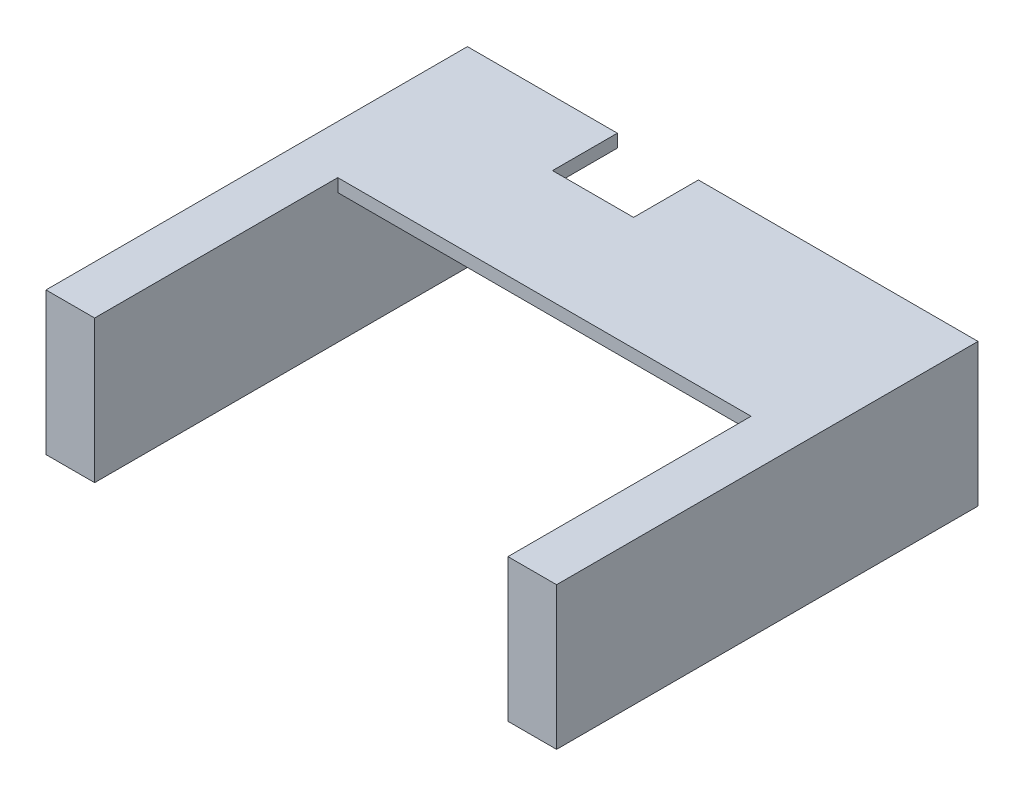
ISO-10303-21;
HEADER;
FILE_DESCRIPTION(('STEP AP214'),'2;1');
FILE_NAME('part.step','',(''),(''),'','','');
FILE_SCHEMA(('AUTOMOTIVE_DESIGN { 1 0 10303 214 1 1 1 1 }'));
ENDSEC;
DATA;
#1=APPLICATION_CONTEXT('core data for automotive mechanical design processes');
#2=APPLICATION_PROTOCOL_DEFINITION('international standard','automotive_design',2000,#1);
#3=PRODUCT_CONTEXT('',#1,'mechanical');
#4=PRODUCT('Part','Part','',(#3));
#5=PRODUCT_RELATED_PRODUCT_CATEGORY('part','',(#4));
#6=PRODUCT_DEFINITION_FORMATION('','',#4);
#7=PRODUCT_DEFINITION_CONTEXT('part definition',#1,'design');
#8=PRODUCT_DEFINITION('design','',#6,#7);
#9=PRODUCT_DEFINITION_SHAPE('','',#8);
#10=(LENGTH_UNIT() NAMED_UNIT(*) SI_UNIT(.MILLI.,.METRE.));
#11=(NAMED_UNIT(*) PLANE_ANGLE_UNIT() SI_UNIT($,.RADIAN.));
#12=(NAMED_UNIT(*) SI_UNIT($,.STERADIAN.) SOLID_ANGLE_UNIT());
#13=UNCERTAINTY_MEASURE_WITH_UNIT(LENGTH_MEASURE(1.E-05),#10,'distance_accuracy_value','');
#14=(GEOMETRIC_REPRESENTATION_CONTEXT(3) GLOBAL_UNCERTAINTY_ASSIGNED_CONTEXT((#13)) GLOBAL_UNIT_ASSIGNED_CONTEXT((#10,
#11,#12)) REPRESENTATION_CONTEXT('',''));
#15=CARTESIAN_POINT('',(0.,0.,0.));
#16=DIRECTION('',(0.,0.,1.));
#17=DIRECTION('',(1.,0.,0.));
#18=AXIS2_PLACEMENT_3D('',#15,#16,#17);
#19=CARTESIAN_POINT('',(0.,0.,0.));
#20=DIRECTION('',(0.,0.,-1.));
#21=DIRECTION('',(-1.,0.,0.));
#22=AXIS2_PLACEMENT_3D('',#19,#20,#21);
#23=PLANE('',#22);
#24=DIRECTION('',(0.,1.,0.));
#25=VECTOR('',#24,1.);
#26=CARTESIAN_POINT('',(142.5,0.,0.));
#27=LINE('',#26,#25);
#28=CARTESIAN_POINT('',(142.5,80.,0.));
#29=VERTEX_POINT('',#28);
#30=CARTESIAN_POINT('',(142.5,88.,0.));
#31=VERTEX_POINT('',#30);
#32=EDGE_CURVE('E135',#29,#31,#27,.T.);
#33=ORIENTED_EDGE('',*,*,#32,.T.);
#34=DIRECTION('',(-1.,0.,0.));
#35=VECTOR('',#34,1.);
#36=CARTESIAN_POINT('',(0.,88.,0.));
#37=LINE('',#36,#35);
#38=CARTESIAN_POINT('',(315.,88.,0.));
#39=VERTEX_POINT('',#38);
#40=EDGE_CURVE('E148',#39,#31,#37,.T.);
#41=ORIENTED_EDGE('',*,*,#40,.F.);
#42=DIRECTION('',(0.,1.,0.));
#43=VECTOR('',#42,1.);
#44=CARTESIAN_POINT('',(315.,0.,0.));
#45=LINE('',#44,#43);
#46=CARTESIAN_POINT('',(315.,0.,0.));
#47=VERTEX_POINT('',#46);
#48=EDGE_CURVE('E165',#47,#39,#45,.T.);
#49=ORIENTED_EDGE('',*,*,#48,.F.);
#50=DIRECTION('',(1.,0.,0.));
#51=VECTOR('',#50,1.);
#52=CARTESIAN_POINT('',(0.,0.,0.));
#53=LINE('',#52,#51);
#54=CARTESIAN_POINT('',(285.,0.,0.));
#55=VERTEX_POINT('',#54);
#56=EDGE_CURVE('E240',#55,#47,#53,.T.);
#57=ORIENTED_EDGE('',*,*,#56,.F.);
#58=DIRECTION('',(0.,1.,0.));
#59=VECTOR('',#58,1.);
#60=CARTESIAN_POINT('',(285.,0.,0.));
#61=LINE('',#60,#59);
#62=CARTESIAN_POINT('',(285.,80.,0.));
#63=VERTEX_POINT('',#62);
#64=EDGE_CURVE('E212',#55,#63,#61,.T.);
#65=ORIENTED_EDGE('',*,*,#64,.T.);
#66=DIRECTION('',(-1.,0.,0.));
#67=VECTOR('',#66,1.);
#68=CARTESIAN_POINT('',(30.,80.,0.));
#69=LINE('',#68,#67);
#70=EDGE_CURVE('E150',#63,#29,#69,.T.);
#71=ORIENTED_EDGE('',*,*,#70,.T.);
#72=EDGE_LOOP('',(#33,#41,#49,#57,#65,#71));
#73=FACE_BOUND('',#72,.T.);
#74=ADVANCED_FACE('F32',(#73),#23,.T.);
#75=CARTESIAN_POINT('',(0.,0.,260.));
#76=DIRECTION('',(0.,0.,-1.));
#77=DIRECTION('',(-1.,0.,0.));
#78=AXIS2_PLACEMENT_3D('',#75,#76,#77);
#79=PLANE('',#78);
#80=DIRECTION('',(0.,-1.,0.));
#81=VECTOR('',#80,1.);
#82=CARTESIAN_POINT('',(30.,0.,260.));
#83=LINE('',#82,#81);
#84=CARTESIAN_POINT('',(30.,88.,260.));
#85=VERTEX_POINT('',#84);
#86=CARTESIAN_POINT('',(30.,0.,260.));
#87=VERTEX_POINT('',#86);
#88=EDGE_CURVE('E207',#85,#87,#83,.T.);
#89=ORIENTED_EDGE('',*,*,#88,.F.);
#90=DIRECTION('',(-1.,0.,0.));
#91=VECTOR('',#90,1.);
#92=CARTESIAN_POINT('',(0.,88.,260.));
#93=LINE('',#92,#91);
#94=CARTESIAN_POINT('',(0.,88.,260.));
#95=VERTEX_POINT('',#94);
#96=EDGE_CURVE('E236',#85,#95,#93,.T.);
#97=ORIENTED_EDGE('',*,*,#96,.T.);
#98=DIRECTION('',(0.,-1.,0.));
#99=VECTOR('',#98,1.);
#100=CARTESIAN_POINT('',(0.,0.,260.));
#101=LINE('',#100,#99);
#102=CARTESIAN_POINT('',(0.,0.,260.));
#103=VERTEX_POINT('',#102);
#104=EDGE_CURVE('E159',#95,#103,#101,.T.);
#105=ORIENTED_EDGE('',*,*,#104,.T.);
#106=DIRECTION('',(1.,0.,0.));
#107=VECTOR('',#106,1.);
#108=CARTESIAN_POINT('',(0.,0.,260.));
#109=LINE('',#108,#107);
#110=EDGE_CURVE('E231',#103,#87,#109,.T.);
#111=ORIENTED_EDGE('',*,*,#110,.T.);
#112=EDGE_LOOP('',(#89,#97,#105,#111));
#113=FACE_BOUND('',#112,.T.);
#114=ADVANCED_FACE('F280',(#113),#79,.F.);
#115=CARTESIAN_POINT('',(0.,0.,260.));
#116=DIRECTION('',(0.,1.,0.));
#117=DIRECTION('',(0.,0.,1.));
#118=AXIS2_PLACEMENT_3D('',#115,#116,#117);
#119=PLANE('',#118);
#120=CARTESIAN_POINT('',(0.,0.,0.));
#121=VERTEX_POINT('',#120);
#122=CARTESIAN_POINT('',(30.,0.,0.));
#123=VERTEX_POINT('',#122);
#124=EDGE_CURVE('E241',#121,#123,#53,.T.);
#125=ORIENTED_EDGE('',*,*,#124,.T.);
#126=DIRECTION('',(0.,0.,1.));
#127=VECTOR('',#126,1.);
#128=CARTESIAN_POINT('',(30.,0.,0.));
#129=LINE('',#128,#127);
#130=EDGE_CURVE('E217',#123,#87,#129,.T.);
#131=ORIENTED_EDGE('',*,*,#130,.T.);
#132=ORIENTED_EDGE('',*,*,#110,.F.);
#133=DIRECTION('',(0.,0.,-1.));
#134=VECTOR('',#133,1.);
#135=CARTESIAN_POINT('',(0.,0.,260.));
#136=LINE('',#135,#134);
#137=EDGE_CURVE('E177',#103,#121,#136,.T.);
#138=ORIENTED_EDGE('',*,*,#137,.T.);
#139=EDGE_LOOP('',(#125,#131,#132,#138));
#140=FACE_BOUND('',#139,.T.);
#141=ADVANCED_FACE('F281',(#140),#119,.F.);
#142=CARTESIAN_POINT('',(0.,0.,260.));
#143=DIRECTION('',(1.,0.,0.));
#144=DIRECTION('',(0.,0.,-1.));
#145=AXIS2_PLACEMENT_3D('',#142,#143,#144);
#146=PLANE('',#145);
#147=DIRECTION('',(0.,-1.,0.));
#148=VECTOR('',#147,1.);
#149=CARTESIAN_POINT('',(0.,0.,0.));
#150=LINE('',#149,#148);
#151=CARTESIAN_POINT('',(0.,88.,0.));
#152=VERTEX_POINT('',#151);
#153=EDGE_CURVE('E223',#152,#121,#150,.T.);
#154=ORIENTED_EDGE('',*,*,#153,.T.);
#155=ORIENTED_EDGE('',*,*,#137,.F.);
#156=ORIENTED_EDGE('',*,*,#104,.F.);
#157=DIRECTION('',(0.,0.,-1.));
#158=VECTOR('',#157,1.);
#159=CARTESIAN_POINT('',(0.,88.,260.));
#160=LINE('',#159,#158);
#161=EDGE_CURVE('E169',#95,#152,#160,.T.);
#162=ORIENTED_EDGE('',*,*,#161,.T.);
#163=EDGE_LOOP('',(#154,#155,#156,#162));
#164=FACE_BOUND('',#163,.T.);
#165=ADVANCED_FACE('F34',(#164),#146,.F.);
#166=CARTESIAN_POINT('',(285.,0.,260.));
#167=VERTEX_POINT('',#166);
#168=CARTESIAN_POINT('',(315.,0.,260.));
#169=VERTEX_POINT('',#168);
#170=EDGE_CURVE('E163',#167,#169,#109,.T.);
#171=ORIENTED_EDGE('',*,*,#170,.F.);
#172=DIRECTION('',(0.,0.,1.));
#173=VECTOR('',#172,1.);
#174=CARTESIAN_POINT('',(285.,0.,0.));
#175=LINE('',#174,#173);
#176=EDGE_CURVE('E227',#55,#167,#175,.T.);
#177=ORIENTED_EDGE('',*,*,#176,.F.);
#178=ORIENTED_EDGE('',*,*,#56,.T.);
#179=DIRECTION('',(0.,0.,-1.));
#180=VECTOR('',#179,1.);
#181=CARTESIAN_POINT('',(315.,0.,260.));
#182=LINE('',#181,#180);
#183=EDGE_CURVE('E174',#169,#47,#182,.T.);
#184=ORIENTED_EDGE('',*,*,#183,.F.);
#185=EDGE_LOOP('',(#171,#177,#178,#184));
#186=FACE_BOUND('',#185,.T.);
#187=ADVANCED_FACE('F249',(#186),#119,.F.);
#188=CARTESIAN_POINT('',(315.,0.,260.));
#189=DIRECTION('',(-1.,0.,0.));
#190=DIRECTION('',(0.,0.,1.));
#191=AXIS2_PLACEMENT_3D('',#188,#189,#190);
#192=PLANE('',#191);
#193=ORIENTED_EDGE('',*,*,#48,.T.);
#194=DIRECTION('',(0.,0.,-1.));
#195=VECTOR('',#194,1.);
#196=CARTESIAN_POINT('',(315.,88.,260.));
#197=LINE('',#196,#195);
#198=CARTESIAN_POINT('',(315.,88.,260.));
#199=VERTEX_POINT('',#198);
#200=EDGE_CURVE('E158',#199,#39,#197,.T.);
#201=ORIENTED_EDGE('',*,*,#200,.F.);
#202=DIRECTION('',(0.,1.,0.));
#203=VECTOR('',#202,1.);
#204=CARTESIAN_POINT('',(315.,0.,260.));
#205=LINE('',#204,#203);
#206=EDGE_CURVE('E234',#169,#199,#205,.T.);
#207=ORIENTED_EDGE('',*,*,#206,.F.);
#208=ORIENTED_EDGE('',*,*,#183,.T.);
#209=EDGE_LOOP('',(#193,#201,#207,#208));
#210=FACE_BOUND('',#209,.T.);
#211=ADVANCED_FACE('F252',(#210),#192,.F.);
#212=CARTESIAN_POINT('',(0.,88.,260.));
#213=DIRECTION('',(0.,-1.,0.));
#214=DIRECTION('',(0.,0.,-1.));
#215=AXIS2_PLACEMENT_3D('',#212,#213,#214);
#216=PLANE('',#215);
#217=ORIENTED_EDGE('',*,*,#40,.T.);
#218=DIRECTION('',(0.,0.,-1.));
#219=VECTOR('',#218,1.);
#220=CARTESIAN_POINT('',(142.5,88.,0.));
#221=LINE('',#220,#219);
#222=CARTESIAN_POINT('',(142.5,88.,40.));
#223=VERTEX_POINT('',#222);
#224=EDGE_CURVE('E132',#223,#31,#221,.T.);
#225=ORIENTED_EDGE('',*,*,#224,.F.);
#226=DIRECTION('',(1.,0.,0.));
#227=VECTOR('',#226,1.);
#228=CARTESIAN_POINT('',(142.5,88.,40.));
#229=LINE('',#228,#227);
#230=CARTESIAN_POINT('',(92.5,88.,40.));
#231=VERTEX_POINT('',#230);
#232=EDGE_CURVE('E152',#231,#223,#229,.T.);
#233=ORIENTED_EDGE('',*,*,#232,.F.);
#234=DIRECTION('',(0.,0.,1.));
#235=VECTOR('',#234,1.);
#236=CARTESIAN_POINT('',(92.5,88.,0.));
#237=LINE('',#236,#235);
#238=CARTESIAN_POINT('',(92.5,88.,0.));
#239=VERTEX_POINT('',#238);
#240=EDGE_CURVE('E142',#239,#231,#237,.T.);
#241=ORIENTED_EDGE('',*,*,#240,.F.);
#242=EDGE_CURVE('E160',#239,#152,#37,.T.);
#243=ORIENTED_EDGE('',*,*,#242,.T.);
#244=ORIENTED_EDGE('',*,*,#161,.F.);
#245=ORIENTED_EDGE('',*,*,#96,.F.);
#246=DIRECTION('',(0.,0.,-1.));
#247=VECTOR('',#246,1.);
#248=CARTESIAN_POINT('',(30.,88.,260.));
#249=LINE('',#248,#247);
#250=CARTESIAN_POINT('',(30.,88.,110.));
#251=VERTEX_POINT('',#250);
#252=EDGE_CURVE('E189',#85,#251,#249,.T.);
#253=ORIENTED_EDGE('',*,*,#252,.T.);
#254=DIRECTION('',(1.,0.,0.));
#255=VECTOR('',#254,1.);
#256=CARTESIAN_POINT('',(30.,88.,110.));
#257=LINE('',#256,#255);
#258=CARTESIAN_POINT('',(285.,88.,110.));
#259=VERTEX_POINT('',#258);
#260=EDGE_CURVE('E198',#251,#259,#257,.T.);
#261=ORIENTED_EDGE('',*,*,#260,.T.);
#262=DIRECTION('',(0.,0.,1.));
#263=VECTOR('',#262,1.);
#264=CARTESIAN_POINT('',(285.,88.,260.));
#265=LINE('',#264,#263);
#266=CARTESIAN_POINT('',(285.,88.,260.));
#267=VERTEX_POINT('',#266);
#268=EDGE_CURVE('E201',#259,#267,#265,.T.);
#269=ORIENTED_EDGE('',*,*,#268,.T.);
#270=EDGE_CURVE('E172',#199,#267,#93,.T.);
#271=ORIENTED_EDGE('',*,*,#270,.F.);
#272=ORIENTED_EDGE('',*,*,#200,.T.);
#273=EDGE_LOOP('',(#217,#225,#233,#241,#243,#244,#245,#253,#261,#269,#271,#272));
#274=FACE_BOUND('',#273,.T.);
#275=ADVANCED_FACE('F155',(#274),#216,.F.);
#276=ORIENTED_EDGE('',*,*,#270,.T.);
#277=DIRECTION('',(0.,1.,0.));
#278=VECTOR('',#277,1.);
#279=CARTESIAN_POINT('',(285.,0.,260.));
#280=LINE('',#279,#278);
#281=EDGE_CURVE('E213',#167,#267,#280,.T.);
#282=ORIENTED_EDGE('',*,*,#281,.F.);
#283=ORIENTED_EDGE('',*,*,#170,.T.);
#284=ORIENTED_EDGE('',*,*,#206,.T.);
#285=EDGE_LOOP('',(#276,#282,#283,#284));
#286=FACE_BOUND('',#285,.T.);
#287=ADVANCED_FACE('F254',(#286),#79,.F.);
#288=DIRECTION('',(0.,1.,0.));
#289=VECTOR('',#288,1.);
#290=CARTESIAN_POINT('',(92.5,0.,0.));
#291=LINE('',#290,#289);
#292=CARTESIAN_POINT('',(92.5,80.,0.));
#293=VERTEX_POINT('',#292);
#294=EDGE_CURVE('E151',#293,#239,#291,.T.);
#295=ORIENTED_EDGE('',*,*,#294,.F.);
#296=CARTESIAN_POINT('',(30.,80.,0.));
#297=VERTEX_POINT('',#296);
#298=EDGE_CURVE('E215',#293,#297,#69,.T.);
#299=ORIENTED_EDGE('',*,*,#298,.T.);
#300=DIRECTION('',(0.,-1.,0.));
#301=VECTOR('',#300,1.);
#302=CARTESIAN_POINT('',(30.,0.,0.));
#303=LINE('',#302,#301);
#304=EDGE_CURVE('E209',#297,#123,#303,.T.);
#305=ORIENTED_EDGE('',*,*,#304,.T.);
#306=ORIENTED_EDGE('',*,*,#124,.F.);
#307=ORIENTED_EDGE('',*,*,#153,.F.);
#308=ORIENTED_EDGE('',*,*,#242,.F.);
#309=EDGE_LOOP('',(#295,#299,#305,#306,#307,#308));
#310=FACE_BOUND('',#309,.T.);
#311=ADVANCED_FACE('F270',(#310),#23,.T.);
#312=CARTESIAN_POINT('',(30.,0.,0.));
#313=DIRECTION('',(-1.,0.,0.));
#314=DIRECTION('',(0.,0.,1.));
#315=AXIS2_PLACEMENT_3D('',#312,#313,#314);
#316=PLANE('',#315);
#317=ORIENTED_EDGE('',*,*,#88,.T.);
#318=ORIENTED_EDGE('',*,*,#130,.F.);
#319=ORIENTED_EDGE('',*,*,#304,.F.);
#320=DIRECTION('',(0.,0.,1.));
#321=VECTOR('',#320,1.);
#322=CARTESIAN_POINT('',(30.,80.,0.));
#323=LINE('',#322,#321);
#324=CARTESIAN_POINT('',(30.,80.,110.));
#325=VERTEX_POINT('',#324);
#326=EDGE_CURVE('E220',#297,#325,#323,.T.);
#327=ORIENTED_EDGE('',*,*,#326,.T.);
#328=DIRECTION('',(0.,-1.,0.));
#329=VECTOR('',#328,1.);
#330=CARTESIAN_POINT('',(30.,88.,110.));
#331=LINE('',#330,#329);
#332=EDGE_CURVE('E203',#251,#325,#331,.T.);
#333=ORIENTED_EDGE('',*,*,#332,.F.);
#334=ORIENTED_EDGE('',*,*,#252,.F.);
#335=EDGE_LOOP('',(#317,#318,#319,#327,#333,#334));
#336=FACE_BOUND('',#335,.T.);
#337=ADVANCED_FACE('F267',(#336),#316,.F.);
#338=CARTESIAN_POINT('',(30.,80.,0.));
#339=DIRECTION('',(0.,1.,0.));
#340=DIRECTION('',(0.,0.,1.));
#341=AXIS2_PLACEMENT_3D('',#338,#339,#340);
#342=PLANE('',#341);
#343=DIRECTION('',(1.,0.,0.));
#344=VECTOR('',#343,1.);
#345=CARTESIAN_POINT('',(30.,80.,40.));
#346=LINE('',#345,#344);
#347=CARTESIAN_POINT('',(92.5,80.,40.));
#348=VERTEX_POINT('',#347);
#349=CARTESIAN_POINT('',(142.5,80.,40.));
#350=VERTEX_POINT('',#349);
#351=EDGE_CURVE('E40',#348,#350,#346,.T.);
#352=ORIENTED_EDGE('',*,*,#351,.T.);
#353=DIRECTION('',(0.,0.,-1.));
#354=VECTOR('',#353,1.);
#355=CARTESIAN_POINT('',(142.5,80.,0.));
#356=LINE('',#355,#354);
#357=EDGE_CURVE('E11',#350,#29,#356,.T.);
#358=ORIENTED_EDGE('',*,*,#357,.T.);
#359=ORIENTED_EDGE('',*,*,#70,.F.);
#360=DIRECTION('',(0.,0.,1.));
#361=VECTOR('',#360,1.);
#362=CARTESIAN_POINT('',(285.,80.,0.));
#363=LINE('',#362,#361);
#364=CARTESIAN_POINT('',(285.,80.,110.));
#365=VERTEX_POINT('',#364);
#366=EDGE_CURVE('E224',#63,#365,#363,.T.);
#367=ORIENTED_EDGE('',*,*,#366,.T.);
#368=DIRECTION('',(1.,0.,0.));
#369=VECTOR('',#368,1.);
#370=CARTESIAN_POINT('',(30.,80.,110.));
#371=LINE('',#370,#369);
#372=EDGE_CURVE('E55',#325,#365,#371,.T.);
#373=ORIENTED_EDGE('',*,*,#372,.F.);
#374=ORIENTED_EDGE('',*,*,#326,.F.);
#375=ORIENTED_EDGE('',*,*,#298,.F.);
#376=DIRECTION('',(0.,0.,1.));
#377=VECTOR('',#376,1.);
#378=CARTESIAN_POINT('',(92.5,80.,0.));
#379=LINE('',#378,#377);
#380=EDGE_CURVE('E180',#293,#348,#379,.T.);
#381=ORIENTED_EDGE('',*,*,#380,.T.);
#382=EDGE_LOOP('',(#352,#358,#359,#367,#373,#374,#375,#381));
#383=FACE_BOUND('',#382,.T.);
#384=ADVANCED_FACE('F184',(#383),#342,.F.);
#385=CARTESIAN_POINT('',(285.,0.,0.));
#386=DIRECTION('',(1.,0.,0.));
#387=DIRECTION('',(0.,0.,-1.));
#388=AXIS2_PLACEMENT_3D('',#385,#386,#387);
#389=PLANE('',#388);
#390=ORIENTED_EDGE('',*,*,#281,.T.);
#391=ORIENTED_EDGE('',*,*,#268,.F.);
#392=DIRECTION('',(0.,-1.,0.));
#393=VECTOR('',#392,1.);
#394=CARTESIAN_POINT('',(285.,88.,110.));
#395=LINE('',#394,#393);
#396=EDGE_CURVE('E205',#259,#365,#395,.T.);
#397=ORIENTED_EDGE('',*,*,#396,.T.);
#398=ORIENTED_EDGE('',*,*,#366,.F.);
#399=ORIENTED_EDGE('',*,*,#64,.F.);
#400=ORIENTED_EDGE('',*,*,#176,.T.);
#401=EDGE_LOOP('',(#390,#391,#397,#398,#399,#400));
#402=FACE_BOUND('',#401,.T.);
#403=ADVANCED_FACE('F258',(#402),#389,.F.);
#404=CARTESIAN_POINT('',(30.,88.,110.));
#405=DIRECTION('',(0.,0.,-1.));
#406=DIRECTION('',(-1.,0.,0.));
#407=AXIS2_PLACEMENT_3D('',#404,#405,#406);
#408=PLANE('',#407);
#409=ORIENTED_EDGE('',*,*,#372,.T.);
#410=ORIENTED_EDGE('',*,*,#396,.F.);
#411=ORIENTED_EDGE('',*,*,#260,.F.);
#412=ORIENTED_EDGE('',*,*,#332,.T.);
#413=EDGE_LOOP('',(#409,#410,#411,#412));
#414=FACE_BOUND('',#413,.T.);
#415=ADVANCED_FACE('F262',(#414),#408,.F.);
#416=CARTESIAN_POINT('',(142.5,0.,0.));
#417=DIRECTION('',(1.,0.,0.));
#418=DIRECTION('',(0.,0.,-1.));
#419=AXIS2_PLACEMENT_3D('',#416,#417,#418);
#420=PLANE('',#419);
#421=DIRECTION('',(0.,1.,0.));
#422=VECTOR('',#421,1.);
#423=CARTESIAN_POINT('',(142.5,0.,40.));
#424=LINE('',#423,#422);
#425=EDGE_CURVE('E137',#350,#223,#424,.T.);
#426=ORIENTED_EDGE('',*,*,#425,.T.);
#427=ORIENTED_EDGE('',*,*,#224,.T.);
#428=ORIENTED_EDGE('',*,*,#32,.F.);
#429=ORIENTED_EDGE('',*,*,#357,.F.);
#430=EDGE_LOOP('',(#426,#427,#428,#429));
#431=FACE_BOUND('',#430,.T.);
#432=ADVANCED_FACE('F134',(#431),#420,.F.);
#433=CARTESIAN_POINT('',(142.5,0.,40.));
#434=DIRECTION('',(0.,0.,1.));
#435=DIRECTION('',(1.,0.,0.));
#436=AXIS2_PLACEMENT_3D('',#433,#434,#435);
#437=PLANE('',#436);
#438=DIRECTION('',(0.,1.,0.));
#439=VECTOR('',#438,1.);
#440=CARTESIAN_POINT('',(92.5,0.,40.));
#441=LINE('',#440,#439);
#442=EDGE_CURVE('E47',#348,#231,#441,.T.);
#443=ORIENTED_EDGE('',*,*,#442,.T.);
#444=ORIENTED_EDGE('',*,*,#232,.T.);
#445=ORIENTED_EDGE('',*,*,#425,.F.);
#446=ORIENTED_EDGE('',*,*,#351,.F.);
#447=EDGE_LOOP('',(#443,#444,#445,#446));
#448=FACE_BOUND('',#447,.T.);
#449=ADVANCED_FACE('F187',(#448),#437,.F.);
#450=CARTESIAN_POINT('',(92.5,0.,0.));
#451=DIRECTION('',(-1.,0.,0.));
#452=DIRECTION('',(0.,0.,1.));
#453=AXIS2_PLACEMENT_3D('',#450,#451,#452);
#454=PLANE('',#453);
#455=ORIENTED_EDGE('',*,*,#294,.T.);
#456=ORIENTED_EDGE('',*,*,#240,.T.);
#457=ORIENTED_EDGE('',*,*,#442,.F.);
#458=ORIENTED_EDGE('',*,*,#380,.F.);
#459=EDGE_LOOP('',(#455,#456,#457,#458));
#460=FACE_BOUND('',#459,.T.);
#461=ADVANCED_FACE('F274',(#460),#454,.F.);
#462=CLOSED_SHELL('',(#74,#114,#141,#165,#187,#211,#275,#287,#311,#337,#384,#403,#415,#432,#449,#461));
#463=MANIFOLD_SOLID_BREP('B2',#462);
#464=ADVANCED_BREP_SHAPE_REPRESENTATION('',(#18,#463),#14);
#465=SHAPE_DEFINITION_REPRESENTATION(#9,#464);
ENDSEC;
END-ISO-10303-21;
